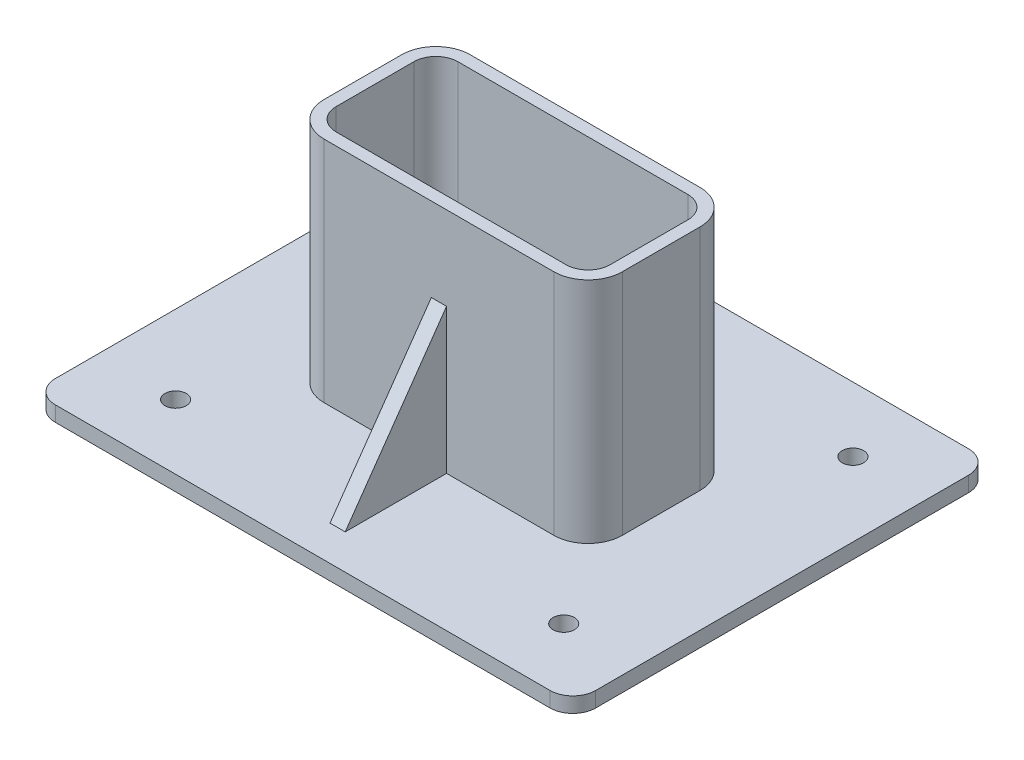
from build123d import *

# Parameters (mm, degrees)
SALIENTE_EXTRUIR2_DEPTH = 150
CROQUIS4_W              = 355
CROQUIS4_H              = 275
SALIENTE_EXTRUIR3_DEPTH = 10
REDONDEO1_R             = 15
CROQUIS5_R              = 7
CORTAR_EXTRUIR1_DEPTH   = 271.023147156
NERVIO5_REACH           = 272.023
CROQUIS6_WALL_W         = 658.12247458
CROQUIS6_WALL_H         = 10


with BuildPart() as part:
    # Croquis2 → Saliente-Extruir2 (new body)
    with BuildSketch(Plane(origin=(0, 0, 0), x_dir=(1, 0, 0), z_dir=(0, 1, 0))):
        with BuildLine():
            ThreePointArc((98, -25.5), (91.409902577, -41.409902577), (75.5, -48))
            Line((75.5, -48), (-75.5, -48))
            ThreePointArc((-75.5, -48), (-91.409902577, -41.409902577), (-98, -25.5))
            Line((-98, -25.5), (-98, 25.5))
            ThreePointArc((-98, 25.5), (-91.409902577, 41.409902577), (-75.5, 48))
            Line((-75.5, 48), (75.5, 48))
            ThreePointArc((75.5, 48), (91.409902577, 41.409902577), (98, 25.5))
            Line((98, 25.5), (98, -25.5))
        make_face()
        with BuildLine():
            Line((90, 25.5), (90, -25.5))
            ThreePointArc((90, -25.5), (85.753048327, -35.753048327), (75.5, -40))
            Line((75.5, -40), (-75.5, -40))
            ThreePointArc((-75.5, -40), (-85.753048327, -35.753048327), (-90, -25.5))
            Line((-90, -25.5), (-90, 25.5))
            ThreePointArc((-90, 25.5), (-85.753048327, 35.753048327), (-75.5, 40))
            Line((-75.5, 40), (75.5, 40))
            ThreePointArc((75.5, 40), (85.753048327, 35.753048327), (90, 25.5))
        make_face(mode=Mode.SUBTRACT)
    extrude(amount=SALIENTE_EXTRUIR2_DEPTH)

    # Croquis4 → Saliente-Extruir3 (add)
    with BuildSketch(Plane(origin=(0, 0, 0), x_dir=(1, 0, 0), z_dir=(0, 1, 0))):
        Rectangle(CROQUIS4_W, CROQUIS4_H)
    extrude(amount=-SALIENTE_EXTRUIR3_DEPTH)

    # Redondeo1
    redondeo1_edges = [part.edges().sort_by_distance(p)[0] for p in [
        (-177.5, -5, 137.5),
        (-177.5, -5, -137.5),
        (177.5, -5, -137.5),
        (177.5, -5, 137.5),
    ]]
    fillet(redondeo1_edges, radius=REDONDEO1_R)

    # Croquis5 → Cortar-Extruir1 (cut, through all)
    with BuildSketch(Plane(origin=(0, 0, 0), x_dir=(1, 0, 0), z_dir=(0, 1, 0))):
        with Locations(Location((128.979591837, 95, 0), (0, 0, 90))):
            Circle(CROQUIS5_R)
        with Locations(Location((-126.020408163, -95, 0), (0, 0, 270))):
            Circle(CROQUIS5_R)
        with Locations(Location((128.979591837, -95, 0), (0, 0, 270))):
            Circle(CROQUIS5_R)
        with Locations(Location((-126.020408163, 95, 0), (0, 0, 90))):
            Circle(CROQUIS5_R)
    extrude(amount=-CORTAR_EXTRUIR1_DEPTH, mode=Mode.SUBTRACT)

    # Croquis6 wall → Nervio5 (add, up to next)
    with BuildSketch(Plane(origin=(0, 47.542020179, 81.289280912), x_dir=(0, -0.819152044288, 0.573576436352), z_dir=(0, -0.573576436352, -0.819152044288)), mode=Mode.PRIVATE) as nervio5_sk1:
        Rectangle(CROQUIS6_WALL_W, CROQUIS6_WALL_H)
    nervio5_tool1 = extrude(nervio5_sk1.sketch, amount=NERVIO5_REACH, mode=Mode.PRIVATE) - part.part
    nervio5 = nervio5_tool1.solids().sort_by_distance((0, 47.542020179, 81.289280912))[0]
    add(nervio5)

    # Simetr_a1: Nervio5 across plane
    add(nervio5.mirror(Plane.XY))


solid = part.part
